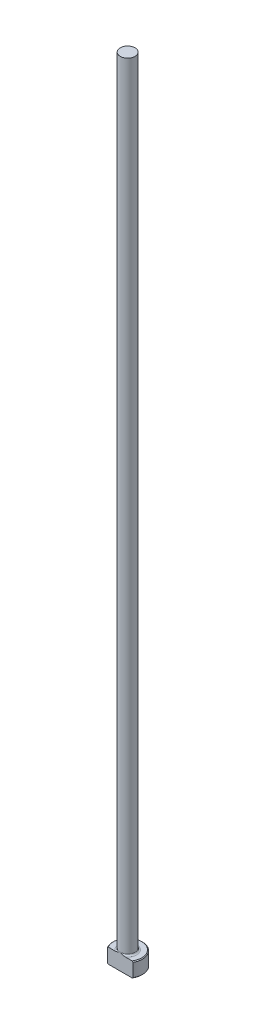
from build123d import *

# Parameters (mm, degrees)
CHAMFER1_SIZE = 0.254
FILLET1_R     = 0.508
KEY_DEPTH     = 255.089281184


with BuildPart() as part:
    # Sketch1 → Revolve1 (revolve)
    with BuildSketch(Plane.XY, mode=Mode.PRIVATE) as revolve1_sk:
        Polygon((0, 0), (-4.7625, 0), (-4.7625, 4.7498), (-2.38125, 4.7498), (-2.38125, 254), (0, 254), align=None)
    revolve(revolve1_sk.sketch.rotate(Axis((0, 259.958771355, 0), (0, -1, 0)), 270), axis=Axis((0, 259.958771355, 0), (0, -1, 0)))

    # Chamfer1
    chamfer1_edges = [part.edges().sort_by_distance(p)[0] for p in [
        (0, 4.7498, -4.7625),
        (0, 0, -4.7625),
    ]]
    chamfer(chamfer1_edges, length=CHAMFER1_SIZE)

    # Fillet1
    fillet1_edges = [part.edges().sort_by_distance(p)[0] for p in [
        (0, 4.7498, -2.38125),
    ]]
    fillet(fillet1_edges, radius=FILLET1_R)

    # Sketch2 → KEY (cut, through all)
    with BuildSketch(Plane.XZ):
        with BuildLine():
            Line((-4.124445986, 2.38125), (4.124445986, 2.38125))
            ThreePointArc((4.124445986, 2.38125), (0, 4.7625), (-4.124445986, 2.38125))
        make_face()
    extrude(amount=-KEY_DEPTH, mode=Mode.SUBTRACT)


solid = part.part
